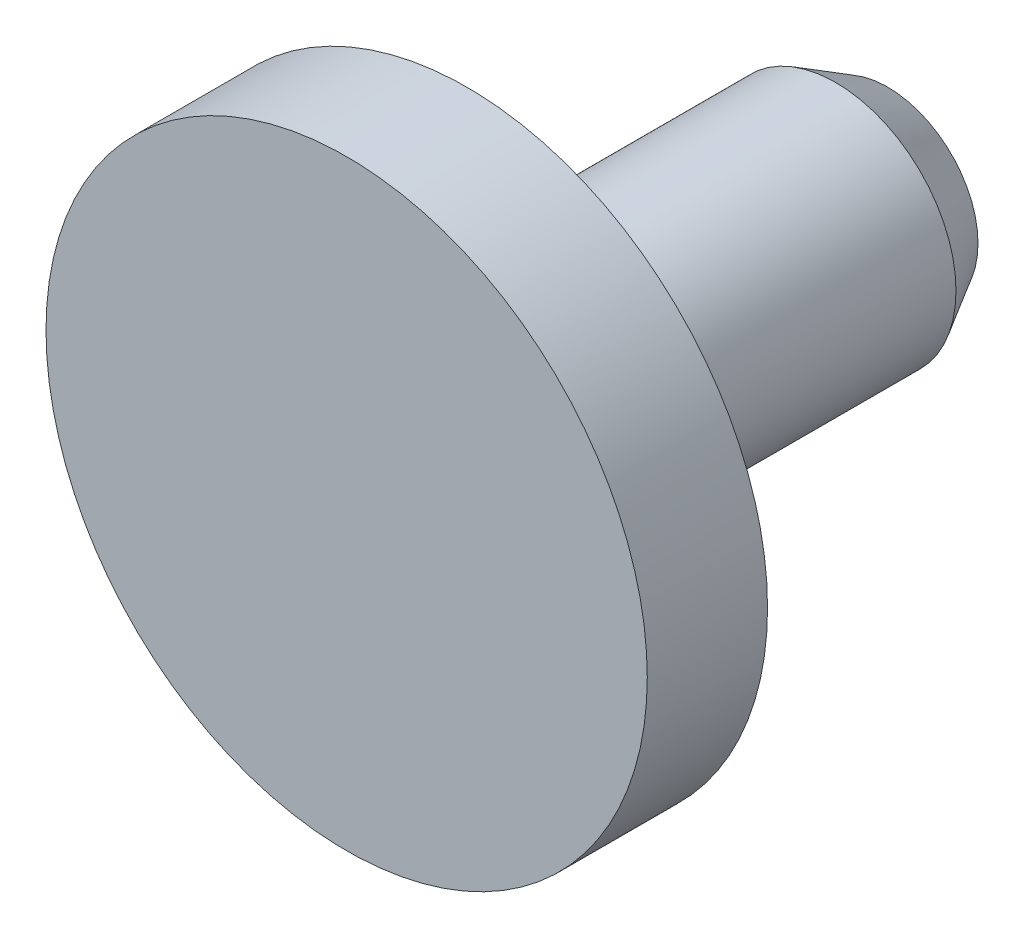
from build123d import *

# Parameters (mm, degrees)
CROQUIS1_R              = 5
SALIENTE_EXTRUIR1_DEPTH = 2
CROQUIS2_R              = 2
SALIENTE_EXTRUIR2_DEPTH = 7
CHAFL_N1_SIZE           = 0.5
CHAFL_N1_SIZE2          = 0.866025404


with BuildPart() as part:
    # Croquis1 → Saliente-Extruir1 (new body)
    with BuildSketch(Plane.XY):
        Circle(CROQUIS1_R)
    extrude(amount=SALIENTE_EXTRUIR1_DEPTH)

    # Croquis2 → Saliente-Extruir2 (add)
    with BuildSketch(Plane.XY):
        Circle(CROQUIS2_R)
    extrude(amount=-SALIENTE_EXTRUIR2_DEPTH)

    # Chafl_n1
    chafl_n1_edges = [part.edges().sort_by_distance(p)[0] for p in [
        (-2, 0, -7),
    ]]
    chafl_n1_side = [part.faces().sort_by_distance(p)[0] for p in [
        (0, 0, -7),
    ]]
    chamfer(chafl_n1_edges, length=CHAFL_N1_SIZE, length2=CHAFL_N1_SIZE2, reference=chafl_n1_side[0])


solid = part.part
